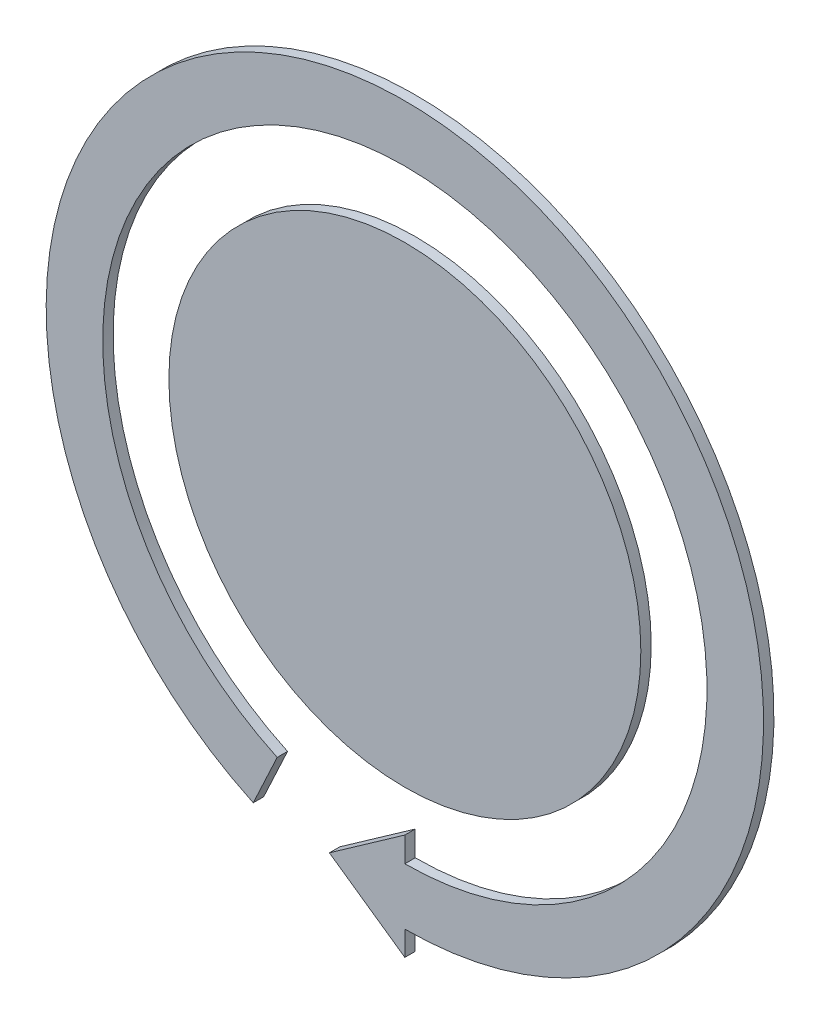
from build123d import *

# Parameters (mm, degrees)
SKIZZE3_R                         = 56.825
AUFSATZ_LINEAR_AUSTRAGEN1_DEPTH   = 2.5
AUFSATZ_LINEAR_AUSTRAGEN1_2_DEPTH = 2.5


with BuildPart() as part:
    # Skizze3 → Aufsatz-Linear austragen1 (new body)
    with BuildSketch(Plane(origin=(0, 0, 0), x_dir=(-1, 0, 0), z_dir=(0, 0, 1))):
        with Locations(Location((0, 0, 0), (0, 0, 180))):
            Circle(SKIZZE3_R)
    extrude(amount=AUFSATZ_LINEAR_AUSTRAGEN1_DEPTH)


with BuildPart() as body_2:
    # Skizze3 → Aufsatz-Linear austragen1 2 (new body)
    with BuildSketch(Plane(origin=(0, 0, 0), x_dir=(-1, 0, 0), z_dir=(0, 0, 1))):
        with BuildLine():
            Line((0, 92.275), (18.177422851, 79.549615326))
            Line((18.177422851, 79.549615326), (0, 66.75))
            Line((0, 66.75), (0, 72.75))
            ThreePointArc((0, 72.75), (-15.745981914, -71.025534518), (30.745478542, 65.933891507))
            Line((30.745478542, 65.933891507), (36.503652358, 78.282335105))
            ThreePointArc((36.503652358, 78.282335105), (-18.694971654, -84.327567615), (0, 86.375))
            Line((0, 86.375), (0, 92.275))
        make_face()
    extrude(amount=AUFSATZ_LINEAR_AUSTRAGEN1_2_DEPTH)


solid = Compound([part.part, body_2.part])
